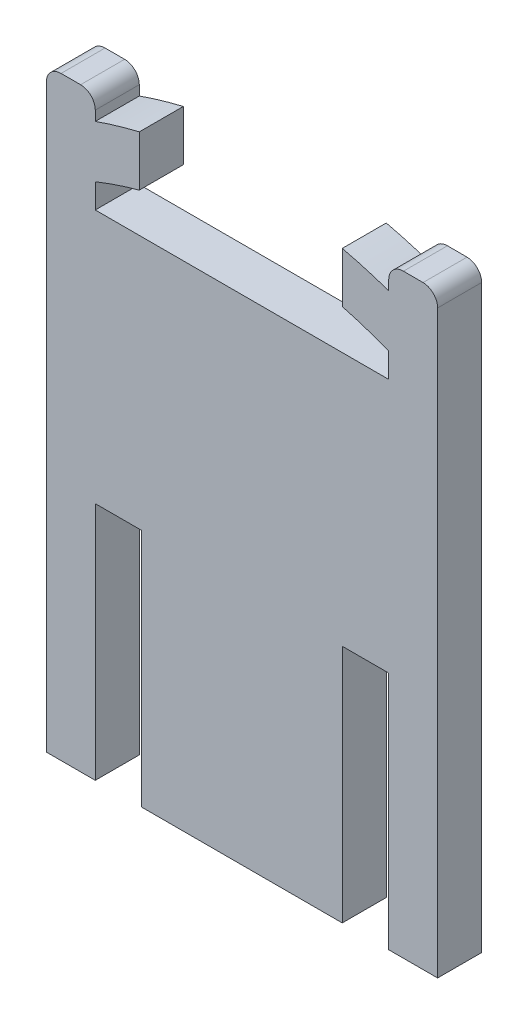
from build123d import *

# Parameters (mm, degrees)
BOSS_EXTRU_1_DEPTH = 9


with BuildPart() as part:
    # Esquisse2 → Boss.-Extru.1 (new body)
    with BuildSketch(Plane.XY):
        with BuildLine():
            Line((-30, 9), (-30, 58))
            Line((-30, 58), (-20.5, 58))
            Line((-20.5, 58), (-20.5, 9))
            Line((-20.5, 9), (20.5, 9))
            Line((20.5, 9), (20.5, 58))
            Line((20.5, 58), (30, 58))
            Line((30, 58), (30, 9))
            Line((30, 9), (40, 9))
            Line((40, 9), (40, 127.654703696))
            ThreePointArc((40, 127.654703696), (39.125633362, 129.771702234), (37.01221146, 130.654678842))
            Line((37.01221146, 130.654678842), (33.01221146, 130.670960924))
            ThreePointArc((33.01221146, 130.670960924), (30.883001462, 129.796619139), (30, 127.670985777))
            Line((30, 127.670985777), (30, 125.683180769))
            ThreePointArc((30, 125.683180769), (25.287875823, 127.196750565), (20.5, 128.450246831))
            Line((20.5, 128.450246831), (20.5, 118.148105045))
            ThreePointArc((20.5, 118.148105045), (25.299014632, 116.721963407), (30, 115))
            Line((30, 115), (30, 110))
            Line((30, 110), (-30, 110))
            Line((-30, 110), (-30, 115))
            ThreePointArc((-30, 115), (-25.544508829, 116.640173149), (-21, 118.014585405))
            Line((-21, 118.014585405), (-21, 128.332367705))
            ThreePointArc((-21, 128.332367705), (-25.534379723, 127.124571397), (-30, 125.683180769))
            Line((-30, 125.683180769), (-30, 127.683222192))
            ThreePointArc((-30, 127.683222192), (-30.878679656, 129.804542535), (-33, 130.683222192))
            Line((-33, 130.683222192), (-37, 130.683222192))
            ThreePointArc((-37, 130.683222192), (-39.121320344, 129.804542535), (-40, 127.683222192))
            Line((-40, 127.683222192), (-40, 9))
            Line((-40, 9), (-30, 9))
        make_face()
    extrude(amount=BOSS_EXTRU_1_DEPTH)


solid = part.part
